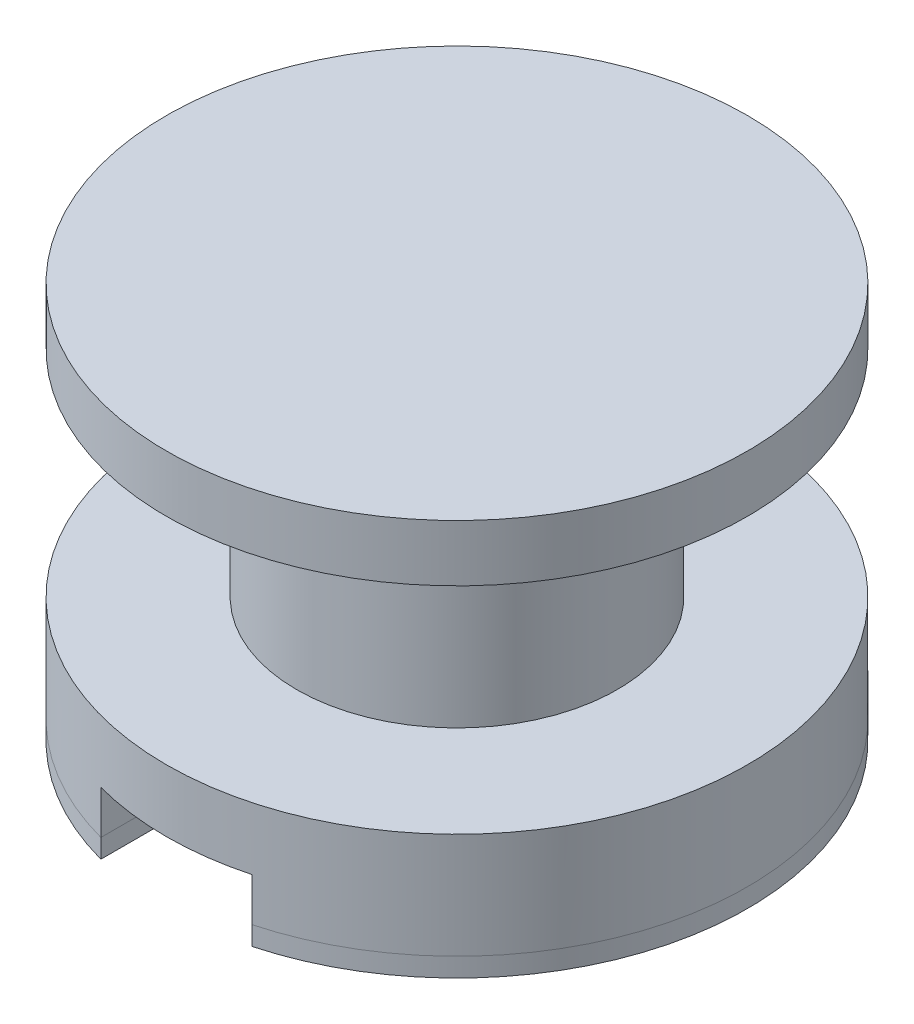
from build123d import *

# Parameters (mm, degrees)
SKETCH1_R             = 3.9116
BOSS_EXTRUDE1_DEPTH   = 1.6764
SKETCH2_W             = 2.032
SKETCH2_H             = 7.8232
CUT_EXTRUDE1_DEPTH    = 0.8382
SKETCH3_R             = 2.159
BOSS_EXTRUDE2_DEPTH   = 2.8956
SKETCH4_R             = 3.9116
BOSS_EXTRUDE3_DEPTH   = 0.762
SKETCH5_R             = 3.9116
CUT_EXTRUDE2_DEPTH    = 0.254
BOSS_EXTRUDE4_DEPTH   = 0.254
BOSS_EXTRUDE4_2_DEPTH = 0.254


with BuildPart() as part:
    # Sketch1 → Boss-Extrude1 (new body)
    with BuildSketch(Plane(origin=(0, 0, 0), x_dir=(1, 0, 0), z_dir=(0, 1, 0))):
        with Locations(Location((0, 0, 0), (0, 0, 270))):
            Circle(SKETCH1_R)
    extrude(amount=BOSS_EXTRUDE1_DEPTH)

    # Sketch2 → Cut-Extrude1 (cut)
    with BuildSketch(Plane.XZ):
        Rectangle(SKETCH2_W, SKETCH2_H)
    extrude(amount=-CUT_EXTRUDE1_DEPTH, mode=Mode.SUBTRACT)

    # Sketch3 → Boss-Extrude2 (add)
    with BuildSketch(Plane(origin=(0, 1.6764, 0), x_dir=(1, 0, 0), z_dir=(0, 1, 0))):
        with Locations(Location((0, 0, 0), (0, 0, 270))):
            Circle(SKETCH3_R)
    extrude(amount=BOSS_EXTRUDE2_DEPTH)

    # Sketch4 → Boss-Extrude3 (add)
    with BuildSketch(Plane(origin=(0, 4.572, 0), x_dir=(1, 0, 0), z_dir=(0, 1, 0))):
        with Locations(Location((0, 0, 0), (0, 0, 74.94534936))):
            Circle(SKETCH4_R)
    extrude(amount=BOSS_EXTRUDE3_DEPTH)

    # Sketch5 → Cut-Extrude2 (cut)
    with BuildSketch(Plane.XZ):
        with Locations(Location((0, 0, 0), (0, 0, 285.05465064))):
            Circle(SKETCH5_R)
    extrude(amount=-CUT_EXTRUDE2_DEPTH, mode=Mode.SUBTRACT)


with BuildPart() as body_2:
    # Sketch6 → Boss-Extrude4 (new body)
    with BuildSketch(Plane.XZ.offset(-0.254)):
        with BuildLine():
            Line((-1.016, 3.777348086), (-1.016, -3.777348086))
            ThreePointArc((-1.016, -3.777348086), (-3.9116, 0), (-1.016, 3.777348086))
        make_face()
    extrude(amount=BOSS_EXTRUDE4_DEPTH)


with BuildPart() as body_3:
    # Sketch6 → Boss-Extrude4 2 (new body)
    with BuildSketch(Plane.XZ.offset(-0.254)):
        with BuildLine():
            Line((1.016, 3.777348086), (1.016, -3.777348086))
            ThreePointArc((1.016, -3.777348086), (3.9116, 0), (1.016, 3.777348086))
        make_face()
    extrude(amount=BOSS_EXTRUDE4_2_DEPTH)


solid = Compound([part.part, body_2.part, body_3.part])
